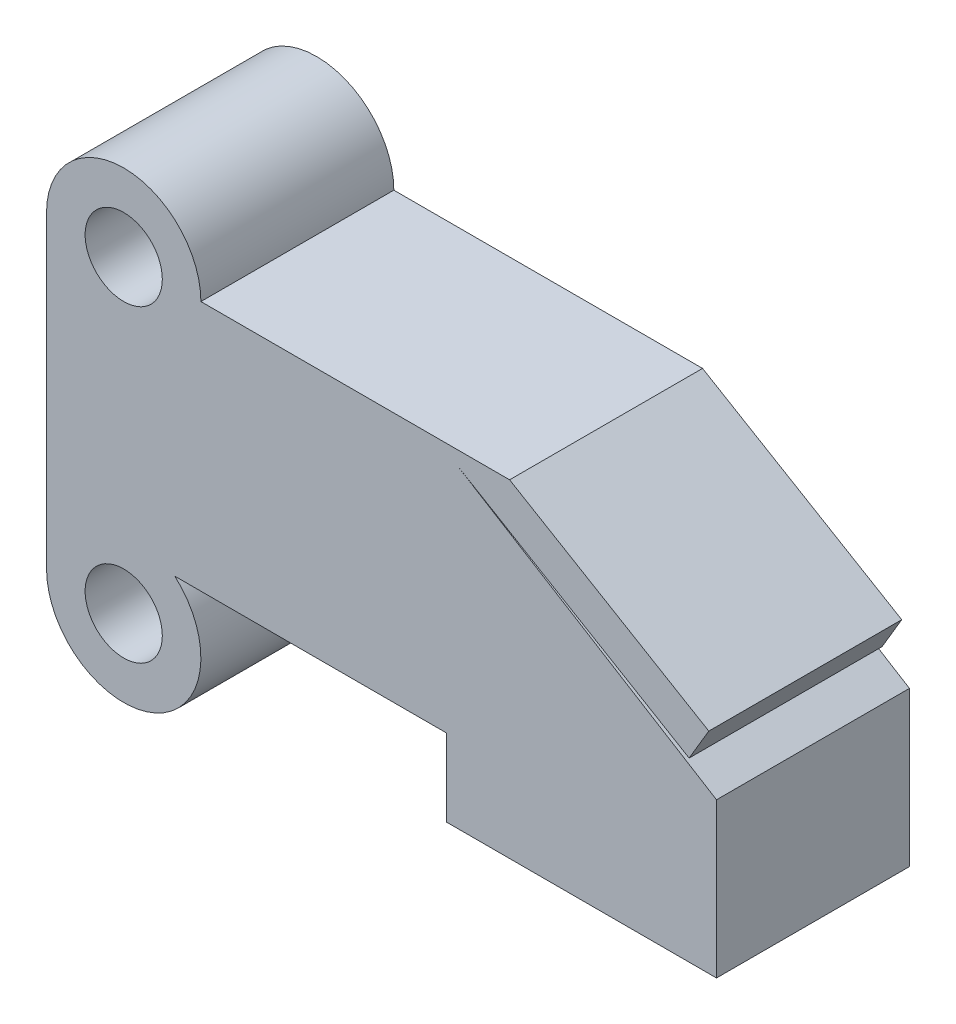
ISO-10303-21;
HEADER;
FILE_DESCRIPTION(('STEP AP214'),'2;1');
FILE_NAME('part.step','',(''),(''),'','','');
FILE_SCHEMA(('AUTOMOTIVE_DESIGN { 1 0 10303 214 1 1 1 1 }'));
ENDSEC;
DATA;
#1=APPLICATION_CONTEXT('core data for automotive mechanical design processes');
#2=APPLICATION_PROTOCOL_DEFINITION('international standard','automotive_design',2000,#1);
#3=PRODUCT_CONTEXT('',#1,'mechanical');
#4=PRODUCT('Part','Part','',(#3));
#5=PRODUCT_RELATED_PRODUCT_CATEGORY('part','',(#4));
#6=PRODUCT_DEFINITION_FORMATION('','',#4);
#7=PRODUCT_DEFINITION_CONTEXT('part definition',#1,'design');
#8=PRODUCT_DEFINITION('design','',#6,#7);
#9=PRODUCT_DEFINITION_SHAPE('','',#8);
#10=(LENGTH_UNIT() NAMED_UNIT(*) SI_UNIT(.MILLI.,.METRE.));
#11=(NAMED_UNIT(*) PLANE_ANGLE_UNIT() SI_UNIT($,.RADIAN.));
#12=(NAMED_UNIT(*) SI_UNIT($,.STERADIAN.) SOLID_ANGLE_UNIT());
#13=UNCERTAINTY_MEASURE_WITH_UNIT(LENGTH_MEASURE(1.E-05),#10,'distance_accuracy_value','');
#14=(GEOMETRIC_REPRESENTATION_CONTEXT(3) GLOBAL_UNCERTAINTY_ASSIGNED_CONTEXT((#13)) GLOBAL_UNIT_ASSIGNED_CONTEXT((#10,
#11,#12)) REPRESENTATION_CONTEXT('',''));
#15=CARTESIAN_POINT('',(0.,0.,0.));
#16=DIRECTION('',(0.,0.,1.));
#17=DIRECTION('',(1.,0.,0.));
#18=AXIS2_PLACEMENT_3D('',#15,#16,#17);
#19=CARTESIAN_POINT('',(0.,-8.,5.));
#20=DIRECTION('',(0.,0.,1.));
#21=DIRECTION('',(1.,0.,0.));
#22=AXIS2_PLACEMENT_3D('',#19,#20,#21);
#23=PLANE('',#22);
#24=CARTESIAN_POINT('',(0.,0.,5.));
#25=DIRECTION('',(0.,0.,1.));
#26=DIRECTION('',(1.,0.,0.));
#27=AXIS2_PLACEMENT_3D('',#24,#25,#26);
#28=CIRCLE('',#27,1.);
#29=CARTESIAN_POINT('',(1.,0.,5.));
#30=VERTEX_POINT('',#29);
#31=EDGE_CURVE('E456',#30,#30,#28,.T.);
#32=ORIENTED_EDGE('',*,*,#31,.F.);
#33=EDGE_LOOP('',(#32));
#34=FACE_BOUND('',#33,.T.);
#35=DIRECTION('',(-0.860307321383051,0.509775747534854,0.));
#36=VECTOR('',#35,1.);
#37=CARTESIAN_POINT('',(10.,0.,5.));
#38=LINE('',#37,#36);
#39=CARTESIAN_POINT('',(15.1618439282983,-3.05865448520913,5.));
#40=VERTEX_POINT('',#39);
#41=CARTESIAN_POINT('',(10.,0.,5.));
#42=VERTEX_POINT('',#41);
#43=EDGE_CURVE('E482',#40,#42,#38,.T.);
#44=ORIENTED_EDGE('',*,*,#43,.T.);
#45=DIRECTION('',(-1.,0.,0.));
#46=VECTOR('',#45,1.);
#47=CARTESIAN_POINT('',(2.,0.,5.));
#48=LINE('',#47,#46);
#49=CARTESIAN_POINT('',(2.,0.,5.));
#50=VERTEX_POINT('',#49);
#51=EDGE_CURVE('E451',#42,#50,#48,.T.);
#52=ORIENTED_EDGE('',*,*,#51,.T.);
#53=CARTESIAN_POINT('',(0.,0.,5.));
#54=DIRECTION('',(0.,0.,1.));
#55=DIRECTION('',(1.,0.,0.));
#56=AXIS2_PLACEMENT_3D('',#53,#54,#55);
#57=CIRCLE('',#56,2.);
#58=CARTESIAN_POINT('',(-2.,0.,5.));
#59=VERTEX_POINT('',#58);
#60=EDGE_CURVE('E485',#50,#59,#57,.T.);
#61=ORIENTED_EDGE('',*,*,#60,.T.);
#62=DIRECTION('',(0.,-1.,0.));
#63=VECTOR('',#62,1.);
#64=CARTESIAN_POINT('',(-2.,0.,5.));
#65=LINE('',#64,#63);
#66=CARTESIAN_POINT('',(-2.,-8.00000000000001,5.));
#67=VERTEX_POINT('',#66);
#68=EDGE_CURVE('E487',#59,#67,#65,.T.);
#69=ORIENTED_EDGE('',*,*,#68,.T.);
#70=CARTESIAN_POINT('',(0.,-8.,5.));
#71=DIRECTION('',(0.,0.,1.));
#72=DIRECTION('',(1.,0.,0.));
#73=AXIS2_PLACEMENT_3D('',#70,#71,#72);
#74=CIRCLE('',#73,2.);
#75=CARTESIAN_POINT('',(1.32287565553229,-6.5,5.));
#76=VERTEX_POINT('',#75);
#77=EDGE_CURVE('E489',#67,#76,#74,.T.);
#78=ORIENTED_EDGE('',*,*,#77,.T.);
#79=DIRECTION('',(1.,0.,0.));
#80=VECTOR('',#79,1.);
#81=CARTESIAN_POINT('',(8.36190264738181,-6.5,5.));
#82=LINE('',#81,#80);
#83=CARTESIAN_POINT('',(8.36190264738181,-6.5,5.));
#84=VERTEX_POINT('',#83);
#85=EDGE_CURVE('E491',#76,#84,#82,.T.);
#86=ORIENTED_EDGE('',*,*,#85,.T.);
#87=DIRECTION('',(0.,-1.,0.));
#88=VECTOR('',#87,1.);
#89=CARTESIAN_POINT('',(8.36190264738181,-8.5,5.));
#90=LINE('',#89,#88);
#91=CARTESIAN_POINT('',(8.36190264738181,-8.5,5.));
#92=VERTEX_POINT('',#91);
#93=EDGE_CURVE('E493',#84,#92,#90,.T.);
#94=ORIENTED_EDGE('',*,*,#93,.T.);
#95=DIRECTION('',(1.,0.,0.));
#96=VECTOR('',#95,1.);
#97=CARTESIAN_POINT('',(15.3619026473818,-8.5,5.));
#98=LINE('',#97,#96);
#99=CARTESIAN_POINT('',(15.3619026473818,-8.5,5.));
#100=VERTEX_POINT('',#99);
#101=EDGE_CURVE('E495',#92,#100,#98,.T.);
#102=ORIENTED_EDGE('',*,*,#101,.T.);
#103=DIRECTION('',(0.,1.,0.));
#104=VECTOR('',#103,1.);
#105=CARTESIAN_POINT('',(15.3619026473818,-4.5,5.));
#106=LINE('',#105,#104);
#107=CARTESIAN_POINT('',(15.3619026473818,-4.5,5.));
#108=VERTEX_POINT('',#107);
#109=EDGE_CURVE('E497',#100,#108,#106,.T.);
#110=ORIENTED_EDGE('',*,*,#109,.T.);
#111=DIRECTION('',(-0.851279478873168,0.524712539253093,0.));
#112=VECTOR('',#111,1.);
#113=CARTESIAN_POINT('',(8.6299169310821,-0.350531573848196,5.));
#114=LINE('',#113,#112);
#115=CARTESIAN_POINT('',(8.6299169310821,-0.350531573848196,5.));
#116=VERTEX_POINT('',#115);
#117=EDGE_CURVE('E499',#108,#116,#114,.T.);
#118=ORIENTED_EDGE('',*,*,#117,.T.);
#119=DIRECTION('',(0.860307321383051,-0.509775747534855,0.));
#120=VECTOR('',#119,1.);
#121=CARTESIAN_POINT('',(14.6520681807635,-3.91896180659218,5.));
#122=LINE('',#121,#120);
#123=CARTESIAN_POINT('',(14.6520681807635,-3.91896180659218,5.));
#124=VERTEX_POINT('',#123);
#125=EDGE_CURVE('E368',#116,#124,#122,.T.);
#126=ORIENTED_EDGE('',*,*,#125,.T.);
#127=DIRECTION('',(0.509775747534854,0.860307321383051,0.));
#128=VECTOR('',#127,1.);
#129=CARTESIAN_POINT('',(15.1618439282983,-3.05865448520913,5.));
#130=LINE('',#129,#128);
#131=EDGE_CURVE('E363',#124,#40,#130,.T.);
#132=ORIENTED_EDGE('',*,*,#131,.T.);
#133=EDGE_LOOP('',(#44,#52,#61,#69,#78,#86,#94,#102,#110,#118,#126,#132));
#134=FACE_BOUND('',#133,.T.);
#135=CARTESIAN_POINT('',(0.,-8.,5.));
#136=DIRECTION('',(0.,0.,1.));
#137=DIRECTION('',(1.,0.,0.));
#138=AXIS2_PLACEMENT_3D('',#135,#136,#137);
#139=CIRCLE('',#138,1.);
#140=CARTESIAN_POINT('',(1.,-8.,5.));
#141=VERTEX_POINT('',#140);
#142=EDGE_CURVE('E602',#141,#141,#139,.T.);
#143=ORIENTED_EDGE('',*,*,#142,.F.);
#144=EDGE_LOOP('',(#143));
#145=FACE_BOUND('',#144,.T.);
#146=ADVANCED_FACE('F348',(#34,#134,#145),#23,.T.);
#147=CARTESIAN_POINT('',(0.,-8.,0.));
#148=DIRECTION('',(0.,0.,1.));
#149=DIRECTION('',(1.,0.,0.));
#150=AXIS2_PLACEMENT_3D('',#147,#148,#149);
#151=PLANE('',#150);
#152=CARTESIAN_POINT('',(0.,0.,0.));
#153=DIRECTION('',(0.,0.,1.));
#154=DIRECTION('',(1.,0.,0.));
#155=AXIS2_PLACEMENT_3D('',#152,#153,#154);
#156=CIRCLE('',#155,1.);
#157=CARTESIAN_POINT('',(1.,0.,0.));
#158=VERTEX_POINT('',#157);
#159=EDGE_CURVE('E459',#158,#158,#156,.T.);
#160=ORIENTED_EDGE('',*,*,#159,.T.);
#161=EDGE_LOOP('',(#160));
#162=FACE_BOUND('',#161,.T.);
#163=DIRECTION('',(-0.860307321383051,0.509775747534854,0.));
#164=VECTOR('',#163,1.);
#165=CARTESIAN_POINT('',(10.,0.,0.));
#166=LINE('',#165,#164);
#167=CARTESIAN_POINT('',(15.1618439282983,-3.05865448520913,0.));
#168=VERTEX_POINT('',#167);
#169=CARTESIAN_POINT('',(10.,0.,0.));
#170=VERTEX_POINT('',#169);
#171=EDGE_CURVE('E442',#168,#170,#166,.T.);
#172=ORIENTED_EDGE('',*,*,#171,.F.);
#173=DIRECTION('',(0.509775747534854,0.860307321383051,0.));
#174=VECTOR('',#173,1.);
#175=CARTESIAN_POINT('',(15.1618439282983,-3.05865448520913,0.));
#176=LINE('',#175,#174);
#177=CARTESIAN_POINT('',(14.6520681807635,-3.91896180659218,0.));
#178=VERTEX_POINT('',#177);
#179=EDGE_CURVE('E480',#178,#168,#176,.T.);
#180=ORIENTED_EDGE('',*,*,#179,.F.);
#181=DIRECTION('',(0.860307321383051,-0.509775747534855,0.));
#182=VECTOR('',#181,1.);
#183=CARTESIAN_POINT('',(14.6520681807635,-3.91896180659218,0.));
#184=LINE('',#183,#182);
#185=CARTESIAN_POINT('',(8.6299169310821,-0.350531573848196,0.));
#186=VERTEX_POINT('',#185);
#187=EDGE_CURVE('E478',#186,#178,#184,.T.);
#188=ORIENTED_EDGE('',*,*,#187,.F.);
#189=DIRECTION('',(-0.851279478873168,0.524712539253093,0.));
#190=VECTOR('',#189,1.);
#191=CARTESIAN_POINT('',(8.6299169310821,-0.350531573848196,0.));
#192=LINE('',#191,#190);
#193=CARTESIAN_POINT('',(15.3619026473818,-4.5,0.));
#194=VERTEX_POINT('',#193);
#195=EDGE_CURVE('E476',#194,#186,#192,.T.);
#196=ORIENTED_EDGE('',*,*,#195,.F.);
#197=DIRECTION('',(0.,1.,0.));
#198=VECTOR('',#197,1.);
#199=CARTESIAN_POINT('',(15.3619026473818,-4.5,0.));
#200=LINE('',#199,#198);
#201=CARTESIAN_POINT('',(15.3619026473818,-8.5,0.));
#202=VERTEX_POINT('',#201);
#203=EDGE_CURVE('E474',#202,#194,#200,.T.);
#204=ORIENTED_EDGE('',*,*,#203,.F.);
#205=DIRECTION('',(1.,0.,0.));
#206=VECTOR('',#205,1.);
#207=CARTESIAN_POINT('',(15.3619026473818,-8.5,0.));
#208=LINE('',#207,#206);
#209=CARTESIAN_POINT('',(8.36190264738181,-8.5,0.));
#210=VERTEX_POINT('',#209);
#211=EDGE_CURVE('E472',#210,#202,#208,.T.);
#212=ORIENTED_EDGE('',*,*,#211,.F.);
#213=DIRECTION('',(0.,-1.,0.));
#214=VECTOR('',#213,1.);
#215=CARTESIAN_POINT('',(8.36190264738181,-8.5,0.));
#216=LINE('',#215,#214);
#217=CARTESIAN_POINT('',(8.36190264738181,-6.5,0.));
#218=VERTEX_POINT('',#217);
#219=EDGE_CURVE('E470',#218,#210,#216,.T.);
#220=ORIENTED_EDGE('',*,*,#219,.F.);
#221=DIRECTION('',(1.,0.,0.));
#222=VECTOR('',#221,1.);
#223=CARTESIAN_POINT('',(8.36190264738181,-6.5,0.));
#224=LINE('',#223,#222);
#225=CARTESIAN_POINT('',(1.32287565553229,-6.5,0.));
#226=VERTEX_POINT('',#225);
#227=EDGE_CURVE('E468',#226,#218,#224,.T.);
#228=ORIENTED_EDGE('',*,*,#227,.F.);
#229=CARTESIAN_POINT('',(0.,-8.,0.));
#230=DIRECTION('',(0.,0.,1.));
#231=DIRECTION('',(1.,0.,0.));
#232=AXIS2_PLACEMENT_3D('',#229,#230,#231);
#233=CIRCLE('',#232,2.);
#234=CARTESIAN_POINT('',(-2.,-8.00000000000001,0.));
#235=VERTEX_POINT('',#234);
#236=EDGE_CURVE('E466',#235,#226,#233,.T.);
#237=ORIENTED_EDGE('',*,*,#236,.F.);
#238=DIRECTION('',(0.,-1.,0.));
#239=VECTOR('',#238,1.);
#240=CARTESIAN_POINT('',(-2.,0.,0.));
#241=LINE('',#240,#239);
#242=CARTESIAN_POINT('',(-2.,0.,0.));
#243=VERTEX_POINT('',#242);
#244=EDGE_CURVE('E464',#243,#235,#241,.T.);
#245=ORIENTED_EDGE('',*,*,#244,.F.);
#246=CARTESIAN_POINT('',(0.,0.,0.));
#247=DIRECTION('',(0.,0.,1.));
#248=DIRECTION('',(1.,0.,0.));
#249=AXIS2_PLACEMENT_3D('',#246,#247,#248);
#250=CIRCLE('',#249,2.);
#251=CARTESIAN_POINT('',(2.,0.,0.));
#252=VERTEX_POINT('',#251);
#253=EDGE_CURVE('E444',#252,#243,#250,.T.);
#254=ORIENTED_EDGE('',*,*,#253,.F.);
#255=DIRECTION('',(-1.,0.,0.));
#256=VECTOR('',#255,1.);
#257=CARTESIAN_POINT('',(2.,0.,0.));
#258=LINE('',#257,#256);
#259=EDGE_CURVE('E437',#170,#252,#258,.T.);
#260=ORIENTED_EDGE('',*,*,#259,.F.);
#261=EDGE_LOOP('',(#172,#180,#188,#196,#204,#212,#220,#228,#237,#245,#254,#260));
#262=FACE_BOUND('',#261,.T.);
#263=CARTESIAN_POINT('',(0.,-8.,0.));
#264=DIRECTION('',(0.,0.,1.));
#265=DIRECTION('',(1.,0.,0.));
#266=AXIS2_PLACEMENT_3D('',#263,#264,#265);
#267=CIRCLE('',#266,1.);
#268=CARTESIAN_POINT('',(1.,-8.,0.));
#269=VERTEX_POINT('',#268);
#270=EDGE_CURVE('E605',#269,#269,#267,.T.);
#271=ORIENTED_EDGE('',*,*,#270,.T.);
#272=EDGE_LOOP('',(#271));
#273=FACE_BOUND('',#272,.T.);
#274=ADVANCED_FACE('F438',(#162,#262,#273),#151,.F.);
#275=CARTESIAN_POINT('',(10.,0.,5.));
#276=DIRECTION('',(-0.509775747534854,-0.860307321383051,0.));
#277=DIRECTION('',(0.860307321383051,-0.509775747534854,0.));
#278=AXIS2_PLACEMENT_3D('',#275,#276,#277);
#279=PLANE('',#278);
#280=ORIENTED_EDGE('',*,*,#171,.T.);
#281=DIRECTION('',(0.,0.,-1.));
#282=VECTOR('',#281,1.);
#283=CARTESIAN_POINT('',(10.,0.,5.));
#284=LINE('',#283,#282);
#285=EDGE_CURVE('E11',#42,#170,#284,.T.);
#286=ORIENTED_EDGE('',*,*,#285,.F.);
#287=ORIENTED_EDGE('',*,*,#43,.F.);
#288=DIRECTION('',(0.,0.,-1.));
#289=VECTOR('',#288,1.);
#290=CARTESIAN_POINT('',(15.1618439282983,-3.05865448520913,5.));
#291=LINE('',#290,#289);
#292=EDGE_CURVE('E455',#40,#168,#291,.T.);
#293=ORIENTED_EDGE('',*,*,#292,.T.);
#294=EDGE_LOOP('',(#280,#286,#287,#293));
#295=FACE_BOUND('',#294,.T.);
#296=ADVANCED_FACE('F350',(#295),#279,.F.);
#297=CARTESIAN_POINT('',(2.,0.,5.));
#298=DIRECTION('',(0.,-1.,0.));
#299=DIRECTION('',(0.,0.,-1.));
#300=AXIS2_PLACEMENT_3D('',#297,#298,#299);
#301=PLANE('',#300);
#302=ORIENTED_EDGE('',*,*,#259,.T.);
#303=DIRECTION('',(0.,0.,-1.));
#304=VECTOR('',#303,1.);
#305=CARTESIAN_POINT('',(2.,0.,5.));
#306=LINE('',#305,#304);
#307=EDGE_CURVE('E356',#50,#252,#306,.T.);
#308=ORIENTED_EDGE('',*,*,#307,.F.);
#309=ORIENTED_EDGE('',*,*,#51,.F.);
#310=ORIENTED_EDGE('',*,*,#285,.T.);
#311=EDGE_LOOP('',(#302,#308,#309,#310));
#312=FACE_BOUND('',#311,.T.);
#313=ADVANCED_FACE('F450',(#312),#301,.F.);
#314=CARTESIAN_POINT('',(0.,0.,5.));
#315=DIRECTION('',(0.,0.,-1.));
#316=DIRECTION('',(-1.,0.,0.));
#317=AXIS2_PLACEMENT_3D('',#314,#315,#316);
#318=CYLINDRICAL_SURFACE('',#317,2.);
#319=ORIENTED_EDGE('',*,*,#253,.T.);
#320=DIRECTION('',(0.,0.,-1.));
#321=VECTOR('',#320,1.);
#322=CARTESIAN_POINT('',(-2.,0.,5.));
#323=LINE('',#322,#321);
#324=EDGE_CURVE('E528',#59,#243,#323,.T.);
#325=ORIENTED_EDGE('',*,*,#324,.F.);
#326=ORIENTED_EDGE('',*,*,#60,.F.);
#327=ORIENTED_EDGE('',*,*,#307,.T.);
#328=EDGE_LOOP('',(#319,#325,#326,#327));
#329=FACE_BOUND('',#328,.T.);
#330=ADVANCED_FACE('F532',(#329),#318,.T.);
#331=CARTESIAN_POINT('',(-2.,0.,5.));
#332=DIRECTION('',(1.,0.,0.));
#333=DIRECTION('',(0.,0.,-1.));
#334=AXIS2_PLACEMENT_3D('',#331,#332,#333);
#335=PLANE('',#334);
#336=ORIENTED_EDGE('',*,*,#244,.T.);
#337=DIRECTION('',(0.,0.,-1.));
#338=VECTOR('',#337,1.);
#339=CARTESIAN_POINT('',(-2.,-8.00000000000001,5.));
#340=LINE('',#339,#338);
#341=EDGE_CURVE('E525',#67,#235,#340,.T.);
#342=ORIENTED_EDGE('',*,*,#341,.F.);
#343=ORIENTED_EDGE('',*,*,#68,.F.);
#344=ORIENTED_EDGE('',*,*,#324,.T.);
#345=EDGE_LOOP('',(#336,#342,#343,#344));
#346=FACE_BOUND('',#345,.T.);
#347=ADVANCED_FACE('F540',(#346),#335,.F.);
#348=CARTESIAN_POINT('',(0.,-8.,5.));
#349=DIRECTION('',(0.,0.,-1.));
#350=DIRECTION('',(-1.,0.,0.));
#351=AXIS2_PLACEMENT_3D('',#348,#349,#350);
#352=CYLINDRICAL_SURFACE('',#351,2.);
#353=ORIENTED_EDGE('',*,*,#236,.T.);
#354=DIRECTION('',(0.,0.,-1.));
#355=VECTOR('',#354,1.);
#356=CARTESIAN_POINT('',(1.32287565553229,-6.5,5.));
#357=LINE('',#356,#355);
#358=EDGE_CURVE('E522',#76,#226,#357,.T.);
#359=ORIENTED_EDGE('',*,*,#358,.F.);
#360=ORIENTED_EDGE('',*,*,#77,.F.);
#361=ORIENTED_EDGE('',*,*,#341,.T.);
#362=EDGE_LOOP('',(#353,#359,#360,#361));
#363=FACE_BOUND('',#362,.T.);
#364=ADVANCED_FACE('F543',(#363),#352,.T.);
#365=CARTESIAN_POINT('',(8.36190264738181,-6.5,5.));
#366=DIRECTION('',(0.,1.,0.));
#367=DIRECTION('',(0.,0.,1.));
#368=AXIS2_PLACEMENT_3D('',#365,#366,#367);
#369=PLANE('',#368);
#370=ORIENTED_EDGE('',*,*,#227,.T.);
#371=DIRECTION('',(0.,0.,-1.));
#372=VECTOR('',#371,1.);
#373=CARTESIAN_POINT('',(8.36190264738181,-6.5,5.));
#374=LINE('',#373,#372);
#375=EDGE_CURVE('E519',#84,#218,#374,.T.);
#376=ORIENTED_EDGE('',*,*,#375,.F.);
#377=ORIENTED_EDGE('',*,*,#85,.F.);
#378=ORIENTED_EDGE('',*,*,#358,.T.);
#379=EDGE_LOOP('',(#370,#376,#377,#378));
#380=FACE_BOUND('',#379,.T.);
#381=ADVANCED_FACE('F548',(#380),#369,.F.);
#382=CARTESIAN_POINT('',(8.36190264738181,-8.5,5.));
#383=DIRECTION('',(1.,0.,0.));
#384=DIRECTION('',(0.,0.,-1.));
#385=AXIS2_PLACEMENT_3D('',#382,#383,#384);
#386=PLANE('',#385);
#387=ORIENTED_EDGE('',*,*,#219,.T.);
#388=DIRECTION('',(0.,0.,-1.));
#389=VECTOR('',#388,1.);
#390=CARTESIAN_POINT('',(8.36190264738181,-8.5,5.));
#391=LINE('',#390,#389);
#392=EDGE_CURVE('E516',#92,#210,#391,.T.);
#393=ORIENTED_EDGE('',*,*,#392,.F.);
#394=ORIENTED_EDGE('',*,*,#93,.F.);
#395=ORIENTED_EDGE('',*,*,#375,.T.);
#396=EDGE_LOOP('',(#387,#393,#394,#395));
#397=FACE_BOUND('',#396,.T.);
#398=ADVANCED_FACE('F554',(#397),#386,.F.);
#399=CARTESIAN_POINT('',(15.3619026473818,-8.5,5.));
#400=DIRECTION('',(0.,1.,0.));
#401=DIRECTION('',(0.,0.,1.));
#402=AXIS2_PLACEMENT_3D('',#399,#400,#401);
#403=PLANE('',#402);
#404=ORIENTED_EDGE('',*,*,#211,.T.);
#405=DIRECTION('',(0.,0.,-1.));
#406=VECTOR('',#405,1.);
#407=CARTESIAN_POINT('',(15.3619026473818,-8.5,5.));
#408=LINE('',#407,#406);
#409=EDGE_CURVE('E513',#100,#202,#408,.T.);
#410=ORIENTED_EDGE('',*,*,#409,.F.);
#411=ORIENTED_EDGE('',*,*,#101,.F.);
#412=ORIENTED_EDGE('',*,*,#392,.T.);
#413=EDGE_LOOP('',(#404,#410,#411,#412));
#414=FACE_BOUND('',#413,.T.);
#415=ADVANCED_FACE('F558',(#414),#403,.F.);
#416=CARTESIAN_POINT('',(15.3619026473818,-4.5,5.));
#417=DIRECTION('',(-1.,0.,0.));
#418=DIRECTION('',(0.,0.,1.));
#419=AXIS2_PLACEMENT_3D('',#416,#417,#418);
#420=PLANE('',#419);
#421=ORIENTED_EDGE('',*,*,#203,.T.);
#422=DIRECTION('',(0.,0.,-1.));
#423=VECTOR('',#422,1.);
#424=CARTESIAN_POINT('',(15.3619026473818,-4.5,5.));
#425=LINE('',#424,#423);
#426=EDGE_CURVE('E510',#108,#194,#425,.T.);
#427=ORIENTED_EDGE('',*,*,#426,.F.);
#428=ORIENTED_EDGE('',*,*,#109,.F.);
#429=ORIENTED_EDGE('',*,*,#409,.T.);
#430=EDGE_LOOP('',(#421,#427,#428,#429));
#431=FACE_BOUND('',#430,.T.);
#432=ADVANCED_FACE('F563',(#431),#420,.F.);
#433=CARTESIAN_POINT('',(8.6299169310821,-0.350531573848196,5.));
#434=DIRECTION('',(-0.524712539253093,-0.851279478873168,0.));
#435=DIRECTION('',(0.851279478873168,-0.524712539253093,0.));
#436=AXIS2_PLACEMENT_3D('',#433,#434,#435);
#437=PLANE('',#436);
#438=ORIENTED_EDGE('',*,*,#195,.T.);
#439=DIRECTION('',(0.,0.,-1.));
#440=VECTOR('',#439,1.);
#441=CARTESIAN_POINT('',(8.6299169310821,-0.350531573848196,5.));
#442=LINE('',#441,#440);
#443=EDGE_CURVE('E507',#116,#186,#442,.T.);
#444=ORIENTED_EDGE('',*,*,#443,.F.);
#445=ORIENTED_EDGE('',*,*,#117,.F.);
#446=ORIENTED_EDGE('',*,*,#426,.T.);
#447=EDGE_LOOP('',(#438,#444,#445,#446));
#448=FACE_BOUND('',#447,.T.);
#449=ADVANCED_FACE('F567',(#448),#437,.F.);
#450=CARTESIAN_POINT('',(14.6520681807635,-3.91896180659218,5.));
#451=DIRECTION('',(0.509775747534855,0.860307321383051,0.));
#452=DIRECTION('',(-0.860307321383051,0.509775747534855,0.));
#453=AXIS2_PLACEMENT_3D('',#450,#451,#452);
#454=PLANE('',#453);
#455=ORIENTED_EDGE('',*,*,#187,.T.);
#456=DIRECTION('',(0.,0.,-1.));
#457=VECTOR('',#456,1.);
#458=CARTESIAN_POINT('',(14.6520681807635,-3.91896180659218,5.));
#459=LINE('',#458,#457);
#460=EDGE_CURVE('E504',#124,#178,#459,.T.);
#461=ORIENTED_EDGE('',*,*,#460,.F.);
#462=ORIENTED_EDGE('',*,*,#125,.F.);
#463=ORIENTED_EDGE('',*,*,#443,.T.);
#464=EDGE_LOOP('',(#455,#461,#462,#463));
#465=FACE_BOUND('',#464,.T.);
#466=ADVANCED_FACE('F571',(#465),#454,.F.);
#467=CARTESIAN_POINT('',(15.1618439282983,-3.05865448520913,5.));
#468=DIRECTION('',(-0.860307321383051,0.509775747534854,0.));
#469=DIRECTION('',(-0.509775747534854,-0.860307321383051,0.));
#470=AXIS2_PLACEMENT_3D('',#467,#468,#469);
#471=PLANE('',#470);
#472=ORIENTED_EDGE('',*,*,#179,.T.);
#473=ORIENTED_EDGE('',*,*,#292,.F.);
#474=ORIENTED_EDGE('',*,*,#131,.F.);
#475=ORIENTED_EDGE('',*,*,#460,.T.);
#476=EDGE_LOOP('',(#472,#473,#474,#475));
#477=FACE_BOUND('',#476,.T.);
#478=ADVANCED_FACE('F573',(#477),#471,.F.);
#479=CARTESIAN_POINT('',(0.,0.,5.));
#480=DIRECTION('',(0.,0.,-1.));
#481=DIRECTION('',(-1.,0.,0.));
#482=AXIS2_PLACEMENT_3D('',#479,#480,#481);
#483=CYLINDRICAL_SURFACE('',#482,1.);
#484=ORIENTED_EDGE('',*,*,#31,.T.);
#485=EDGE_LOOP('',(#484));
#486=FACE_BOUND('',#485,.T.);
#487=ORIENTED_EDGE('',*,*,#159,.F.);
#488=EDGE_LOOP('',(#487));
#489=FACE_BOUND('',#488,.T.);
#490=ADVANCED_FACE('F575',(#486,#489),#483,.F.);
#491=CARTESIAN_POINT('',(0.,-8.,5.));
#492=DIRECTION('',(0.,0.,-1.));
#493=DIRECTION('',(-1.,0.,0.));
#494=AXIS2_PLACEMENT_3D('',#491,#492,#493);
#495=CYLINDRICAL_SURFACE('',#494,1.);
#496=ORIENTED_EDGE('',*,*,#142,.T.);
#497=EDGE_LOOP('',(#496));
#498=FACE_BOUND('',#497,.T.);
#499=ORIENTED_EDGE('',*,*,#270,.F.);
#500=EDGE_LOOP('',(#499));
#501=FACE_BOUND('',#500,.T.);
#502=ADVANCED_FACE('F581',(#498,#501),#495,.F.);
#503=CLOSED_SHELL('',(#146,#274,#296,#313,#330,#347,#364,#381,#398,#415,#432,#449,#466,#478,
#490,#502));
#504=MANIFOLD_SOLID_BREP('B2',#503);
#505=ADVANCED_BREP_SHAPE_REPRESENTATION('',(#18,#504),#14);
#506=SHAPE_DEFINITION_REPRESENTATION(#9,#505);
ENDSEC;
END-ISO-10303-21;
